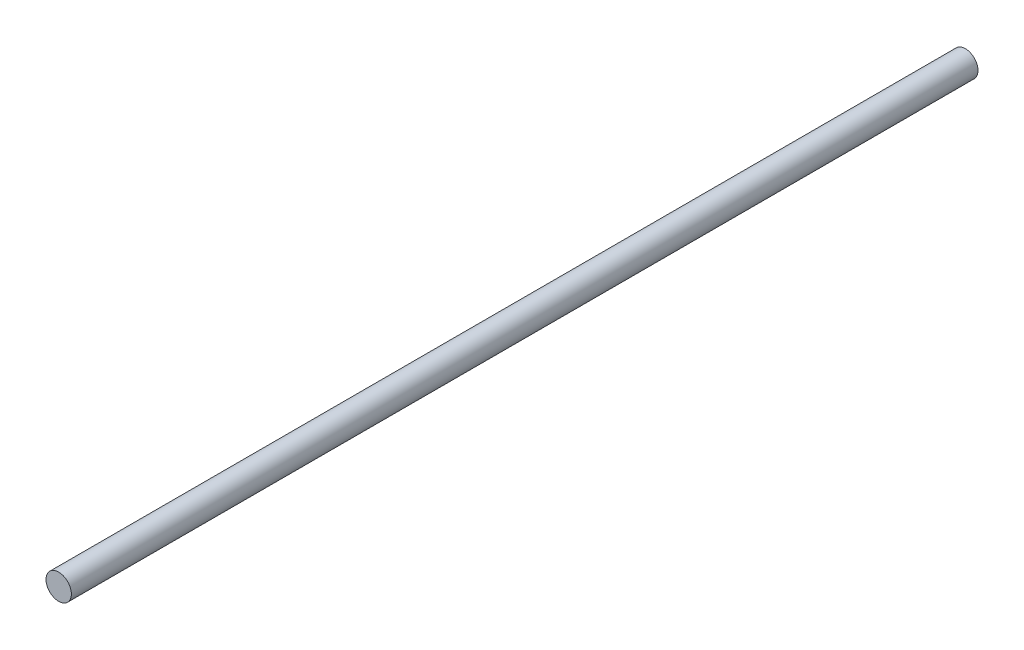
ISO-10303-21;
HEADER;
FILE_DESCRIPTION(('STEP AP214'),'2;1');
FILE_NAME('part.step','',(''),(''),'','','');
FILE_SCHEMA(('AUTOMOTIVE_DESIGN { 1 0 10303 214 1 1 1 1 }'));
ENDSEC;
DATA;
#1=APPLICATION_CONTEXT('core data for automotive mechanical design processes');
#2=APPLICATION_PROTOCOL_DEFINITION('international standard','automotive_design',2000,#1);
#3=PRODUCT_CONTEXT('',#1,'mechanical');
#4=PRODUCT('Part','Part','',(#3));
#5=PRODUCT_RELATED_PRODUCT_CATEGORY('part','',(#4));
#6=PRODUCT_DEFINITION_FORMATION('','',#4);
#7=PRODUCT_DEFINITION_CONTEXT('part definition',#1,'design');
#8=PRODUCT_DEFINITION('design','',#6,#7);
#9=PRODUCT_DEFINITION_SHAPE('','',#8);
#10=(LENGTH_UNIT() NAMED_UNIT(*) SI_UNIT(.MILLI.,.METRE.));
#11=(NAMED_UNIT(*) PLANE_ANGLE_UNIT() SI_UNIT($,.RADIAN.));
#12=(NAMED_UNIT(*) SI_UNIT($,.STERADIAN.) SOLID_ANGLE_UNIT());
#13=UNCERTAINTY_MEASURE_WITH_UNIT(LENGTH_MEASURE(1.E-05),#10,'distance_accuracy_value','');
#14=(GEOMETRIC_REPRESENTATION_CONTEXT(3) GLOBAL_UNCERTAINTY_ASSIGNED_CONTEXT((#13)) GLOBAL_UNIT_ASSIGNED_CONTEXT((#10,
#11,#12)) REPRESENTATION_CONTEXT('',''));
#15=CARTESIAN_POINT('',(0.,0.,0.));
#16=DIRECTION('',(0.,0.,1.));
#17=DIRECTION('',(1.,0.,0.));
#18=AXIS2_PLACEMENT_3D('',#15,#16,#17);
#19=CARTESIAN_POINT('',(0.,0.,57.2186135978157));
#20=DIRECTION('',(0.,0.,1.));
#21=DIRECTION('',(1.,0.,0.));
#22=AXIS2_PLACEMENT_3D('',#19,#20,#21);
#23=PLANE('',#22);
#24=CARTESIAN_POINT('',(0.,0.,57.2186135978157));
#25=DIRECTION('',(0.,0.,-1.));
#26=DIRECTION('',(-1.,0.,0.));
#27=AXIS2_PLACEMENT_3D('',#24,#25,#26);
#28=CIRCLE('',#27,1.6);
#29=CARTESIAN_POINT('',(-1.6,0.,57.2186135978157));
#30=VERTEX_POINT('',#29);
#31=EDGE_CURVE('E10',#30,#30,#28,.T.);
#32=ORIENTED_EDGE('',*,*,#31,.F.);
#33=EDGE_LOOP('',(#32));
#34=FACE_BOUND('',#33,.T.);
#35=ADVANCED_FACE('F15',(#34),#23,.T.);
#36=CARTESIAN_POINT('',(0.,0.,-57.2186135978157));
#37=DIRECTION('',(0.,0.,-1.));
#38=DIRECTION('',(-1.,0.,0.));
#39=AXIS2_PLACEMENT_3D('',#36,#37,#38);
#40=PLANE('',#39);
#41=CARTESIAN_POINT('',(0.,0.,-57.2186135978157));
#42=DIRECTION('',(0.,0.,1.));
#43=DIRECTION('',(1.,0.,0.));
#44=AXIS2_PLACEMENT_3D('',#41,#42,#43);
#45=CIRCLE('',#44,1.6);
#46=CARTESIAN_POINT('',(1.6,0.,-57.2186135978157));
#47=VERTEX_POINT('',#46);
#48=EDGE_CURVE('E22',#47,#47,#45,.T.);
#49=ORIENTED_EDGE('',*,*,#48,.F.);
#50=EDGE_LOOP('',(#49));
#51=FACE_BOUND('',#50,.T.);
#52=ADVANCED_FACE('F26',(#51),#40,.T.);
#53=CARTESIAN_POINT('',(0.,0.,-57.2186135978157));
#54=DIRECTION('',(0.,0.,1.));
#55=DIRECTION('',(1.,0.,0.));
#56=AXIS2_PLACEMENT_3D('',#53,#54,#55);
#57=CYLINDRICAL_SURFACE('',#56,1.6);
#58=ORIENTED_EDGE('',*,*,#31,.T.);
#59=EDGE_LOOP('',(#58));
#60=FACE_BOUND('',#59,.T.);
#61=ORIENTED_EDGE('',*,*,#48,.T.);
#62=EDGE_LOOP('',(#61));
#63=FACE_BOUND('',#62,.T.);
#64=ADVANCED_FACE('F17',(#60,#63),#57,.T.);
#65=CLOSED_SHELL('',(#35,#52,#64));
#66=MANIFOLD_SOLID_BREP('B1',#65);
#67=ADVANCED_BREP_SHAPE_REPRESENTATION('',(#18,#66),#14);
#68=SHAPE_DEFINITION_REPRESENTATION(#9,#67);
ENDSEC;
END-ISO-10303-21;
